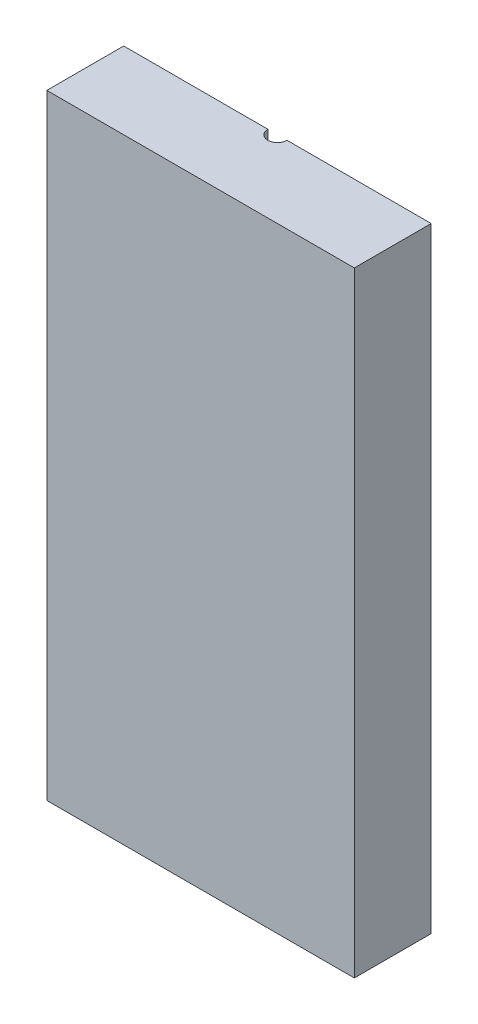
from build123d import *

# Parameters (mm, degrees)
BOSS_EXTRUDE1_DEPTH = 50.8


with BuildPart() as part:
    # Sketch1 → Boss-Extrude1 (new body)
    with BuildSketch(Plane(origin=(0, 0, 0), x_dir=(1, 0, 0), z_dir=(0, 1, 0))):
        with BuildLine():
            Line((0.79375, 3.175), (12.7, 3.175))
            Line((12.7, 3.175), (12.7, -3.175))
            Line((12.7, -3.175), (-12.7, -3.175))
            Line((-12.7, -3.175), (-12.7, 3.175))
            Line((-12.7, 3.175), (-0.79375, 3.175))
            ThreePointArc((-0.79375, 3.175), (0, 2.38125), (0.79375, 3.175))
        make_face()
    extrude(amount=BOSS_EXTRUDE1_DEPTH)


solid = part.part
